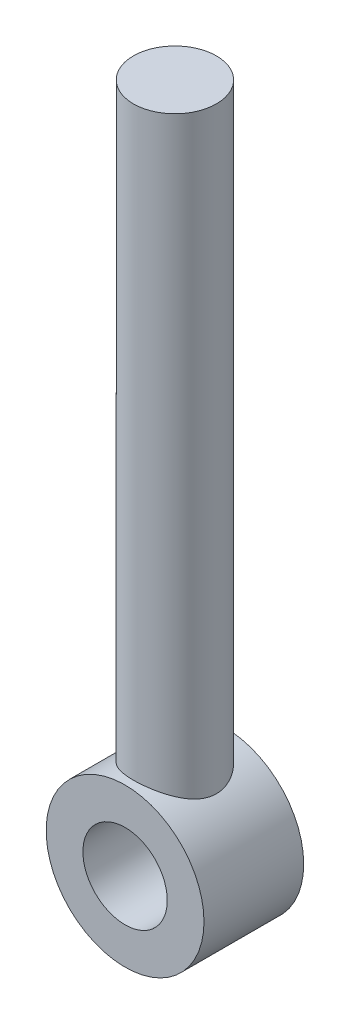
ISO-10303-21;
HEADER;
FILE_DESCRIPTION(('STEP AP214'),'2;1');
FILE_NAME('part.step','',(''),(''),'','','');
FILE_SCHEMA(('AUTOMOTIVE_DESIGN { 1 0 10303 214 1 1 1 1 }'));
ENDSEC;
DATA;
#1=APPLICATION_CONTEXT('core data for automotive mechanical design processes');
#2=APPLICATION_PROTOCOL_DEFINITION('international standard','automotive_design',2000,#1);
#3=PRODUCT_CONTEXT('',#1,'mechanical');
#4=PRODUCT('Part','Part','',(#3));
#5=PRODUCT_RELATED_PRODUCT_CATEGORY('part','',(#4));
#6=PRODUCT_DEFINITION_FORMATION('','',#4);
#7=PRODUCT_DEFINITION_CONTEXT('part definition',#1,'design');
#8=PRODUCT_DEFINITION('design','',#6,#7);
#9=PRODUCT_DEFINITION_SHAPE('','',#8);
#10=(LENGTH_UNIT() NAMED_UNIT(*) SI_UNIT(.MILLI.,.METRE.));
#11=(NAMED_UNIT(*) PLANE_ANGLE_UNIT() SI_UNIT($,.RADIAN.));
#12=(NAMED_UNIT(*) SI_UNIT($,.STERADIAN.) SOLID_ANGLE_UNIT());
#13=UNCERTAINTY_MEASURE_WITH_UNIT(LENGTH_MEASURE(1.E-05),#10,'distance_accuracy_value','');
#14=(GEOMETRIC_REPRESENTATION_CONTEXT(3) GLOBAL_UNCERTAINTY_ASSIGNED_CONTEXT((#13)) GLOBAL_UNIT_ASSIGNED_CONTEXT((#10,
#11,#12)) REPRESENTATION_CONTEXT('',''));
#15=CARTESIAN_POINT('',(0.,0.,0.));
#16=DIRECTION('',(0.,0.,1.));
#17=DIRECTION('',(1.,0.,0.));
#18=AXIS2_PLACEMENT_3D('',#15,#16,#17);
#19=CARTESIAN_POINT('',(0.,-12.7,-9.525));
#20=DIRECTION('',(0.,0.,1.));
#21=DIRECTION('',(1.,0.,0.));
#22=AXIS2_PLACEMENT_3D('',#19,#20,#21);
#23=CYLINDRICAL_SURFACE('',#22,15.08125);
#24=CARTESIAN_POINT('',(0.,-12.7,9.525));
#25=DIRECTION('',(0.,0.,1.));
#26=DIRECTION('',(1.,0.,0.));
#27=AXIS2_PLACEMENT_3D('',#24,#25,#26);
#28=CIRCLE('',#27,15.08125);
#29=CARTESIAN_POINT('',(15.08125,-12.7,9.525));
#30=VERTEX_POINT('',#29);
#31=EDGE_CURVE('E54',#30,#30,#28,.T.);
#32=ORIENTED_EDGE('',*,*,#31,.F.);
#33=EDGE_LOOP('',(#32));
#34=FACE_BOUND('',#33,.T.);
#35=CARTESIAN_POINT('',(0.,-12.7,-9.525));
#36=DIRECTION('',(0.,0.,1.));
#37=DIRECTION('',(1.,0.,0.));
#38=AXIS2_PLACEMENT_3D('',#35,#36,#37);
#39=CIRCLE('',#38,15.08125);
#40=CARTESIAN_POINT('',(15.08125,-12.7,-9.525));
#41=VERTEX_POINT('',#40);
#42=EDGE_CURVE('E47',#41,#41,#39,.T.);
#43=ORIENTED_EDGE('',*,*,#42,.T.);
#44=EDGE_LOOP('',(#43));
#45=FACE_BOUND('',#44,.T.);
#46=CARTESIAN_POINT('',(0.,2.38124999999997,-7.9375));
#47=CARTESIAN_POINT('',(-0.207394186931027,2.38125040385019,-7.93750049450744));
#48=CARTESIAN_POINT('',(-0.414782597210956,2.37696275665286,-7.92936320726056));
#49=CARTESIAN_POINT('',(-0.828014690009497,2.35992263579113,-7.89691493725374));
#50=CARTESIAN_POINT('',(-1.03385778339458,2.34716708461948,-7.87259807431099));
#51=CARTESIAN_POINT('',(-1.44260073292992,2.31349757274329,-7.80805173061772));
#52=CARTESIAN_POINT('',(-1.64549681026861,2.29257395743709,-7.7678034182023));
#53=CARTESIAN_POINT('',(-2.04672691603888,2.24308855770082,-7.67185684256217));
#54=CARTESIAN_POINT('',(-2.24505904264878,2.2145236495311,-7.61615226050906));
#55=CARTESIAN_POINT('',(-2.63491366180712,2.15059475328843,-7.49018721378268));
#56=CARTESIAN_POINT('',(-2.82646261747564,2.11526170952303,-7.41999288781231));
#57=CARTESIAN_POINT('',(-3.20259508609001,2.03853448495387,-7.26558126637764));
#58=CARTESIAN_POINT('',(-3.38717606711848,1.99713812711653,-7.1813589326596));
#59=CARTESIAN_POINT('',(-3.92877765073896,1.86524976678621,-6.90881639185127));
#60=CARTESIAN_POINT('',(-4.27405558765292,1.76699022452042,-6.7004903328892));
#61=CARTESIAN_POINT('',(-4.94790708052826,1.55116303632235,-6.22126354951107));
#62=CARTESIAN_POINT('',(-5.27394005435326,1.43275593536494,-5.94717795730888));
#63=CARTESIAN_POINT('',(-5.72656002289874,1.25267514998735,-5.50049825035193));
#64=CARTESIAN_POINT('',(-5.87145684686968,1.19219018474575,-5.34555005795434));
#65=CARTESIAN_POINT('',(-6.14854891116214,1.07179123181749,-5.02436250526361));
#66=CARTESIAN_POINT('',(-6.28074192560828,1.01187734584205,-4.85812117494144));
#67=CARTESIAN_POINT('',(-6.54281317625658,0.888910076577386,-4.49989226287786));
#68=CARTESIAN_POINT('',(-6.67144914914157,0.826048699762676,-4.30692847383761));
#69=CARTESIAN_POINT('',(-6.91183439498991,0.704803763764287,-3.90952046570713));
#70=CARTESIAN_POINT('',(-7.02359075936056,0.646418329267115,-3.70508111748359));
#71=CARTESIAN_POINT('',(-7.22924412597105,0.536153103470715,-3.28579312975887));
#72=CARTESIAN_POINT('',(-7.32314701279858,0.484271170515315,-3.07094794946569));
#73=CARTESIAN_POINT('',(-7.49206601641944,0.389020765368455,-2.63212910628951));
#74=CARTESIAN_POINT('',(-7.56708444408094,0.345651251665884,-2.40815656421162));
#75=CARTESIAN_POINT('',(-7.6931561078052,0.271679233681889,-1.96687473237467));
#76=CARTESIAN_POINT('',(-7.74540656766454,0.240452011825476,-1.75001291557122));
#77=CARTESIAN_POINT('',(-7.83160147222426,0.188470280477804,-1.31143209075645));
#78=CARTESIAN_POINT('',(-7.86554678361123,0.167715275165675,-1.08971331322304));
#79=CARTESIAN_POINT('',(-7.91453790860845,0.137640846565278,-0.643651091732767));
#80=CARTESIAN_POINT('',(-7.92960310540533,0.128309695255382,-0.419310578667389));
#81=CARTESIAN_POINT('',(-7.9406227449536,0.121492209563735,0.0300080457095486));
#82=CARTESIAN_POINT('',(-7.93657938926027,0.124004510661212,0.254986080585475));
#83=CARTESIAN_POINT('',(-7.91132031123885,0.139598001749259,0.672716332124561));
#84=CARTESIAN_POINT('',(-7.89252309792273,0.151190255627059,0.865676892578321));
#85=CARTESIAN_POINT('',(-7.84098674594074,0.18269935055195,1.2491027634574));
#86=CARTESIAN_POINT('',(-7.80824306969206,0.202618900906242,1.43956724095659));
#87=CARTESIAN_POINT('',(-7.72921466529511,0.250114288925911,1.81666250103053));
#88=CARTESIAN_POINT('',(-7.68293100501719,0.277689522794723,2.00329358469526));
#89=CARTESIAN_POINT('',(-7.57730353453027,0.339644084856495,2.37173405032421));
#90=CARTESIAN_POINT('',(-7.51795447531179,0.374026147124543,2.55354146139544));
#91=CARTESIAN_POINT('',(-7.38529913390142,0.449425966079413,2.91534096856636));
#92=CARTESIAN_POINT('',(-7.31171123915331,0.490574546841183,3.09520227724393));
#93=CARTESIAN_POINT('',(-7.15205829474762,0.577817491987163,3.44811460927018));
#94=CARTESIAN_POINT('',(-7.06598912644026,0.623913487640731,3.62116336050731));
#95=CARTESIAN_POINT('',(-6.88196115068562,0.719891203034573,3.95975400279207));
#96=CARTESIAN_POINT('',(-6.78400034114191,0.769773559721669,4.12529462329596));
#97=CARTESIAN_POINT('',(-6.57674863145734,0.872171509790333,4.44827008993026));
#98=CARTESIAN_POINT('',(-6.4674570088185,0.924687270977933,4.60570441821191));
#99=CARTESIAN_POINT('',(-6.22168528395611,1.03883585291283,4.93379435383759));
#100=CARTESIAN_POINT('',(-6.08355065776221,1.10070067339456,5.10313285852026));
#101=CARTESIAN_POINT('',(-5.7938748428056,1.22479607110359,5.42978641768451));
#102=CARTESIAN_POINT('',(-5.64233293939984,1.28702666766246,5.58710083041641));
#103=CARTESIAN_POINT('',(-5.32646473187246,1.41033769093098,5.88900925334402));
#104=CARTESIAN_POINT('',(-5.16213193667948,1.47141751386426,6.03359672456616));
#105=CARTESIAN_POINT('',(-4.82146501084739,1.59091194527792,6.30915082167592));
#106=CARTESIAN_POINT('',(-4.6451292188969,1.64932618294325,6.44011555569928));
#107=CARTESIAN_POINT('',(-4.2709149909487,1.76526522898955,6.69456893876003));
#108=CARTESIAN_POINT('',(-4.07238159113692,1.82254982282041,6.81720675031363));
#109=CARTESIAN_POINT('',(-3.66406217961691,1.93090355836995,7.04508248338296));
#110=CARTESIAN_POINT('',(-3.45428133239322,1.98197551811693,7.15032830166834));
#111=CARTESIAN_POINT('',(-3.02484600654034,2.07642422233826,7.34230893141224));
#112=CARTESIAN_POINT('',(-2.80519594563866,2.11980436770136,7.42905192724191));
#113=CARTESIAN_POINT('',(-2.35760575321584,2.19756235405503,7.58298003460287));
#114=CARTESIAN_POINT('',(-2.12966669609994,2.23194135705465,7.65016767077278));
#115=CARTESIAN_POINT('',(-1.68790767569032,2.28800105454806,7.75899170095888));
#116=CARTESIAN_POINT('',(-1.47462238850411,2.31053601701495,7.80236259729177));
#117=CARTESIAN_POINT('',(-1.04446183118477,2.34658661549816,7.87149588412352));
#118=CARTESIAN_POINT('',(-0.827586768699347,2.36010277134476,7.89725928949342));
#119=CARTESIAN_POINT('',(-0.392170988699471,2.37772391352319,7.93081121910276));
#120=CARTESIAN_POINT('',(-0.173631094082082,2.38183328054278,7.93860811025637));
#121=CARTESIAN_POINT('',(0.26331263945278,2.38053339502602,7.93613857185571));
#122=CARTESIAN_POINT('',(0.481716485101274,2.37512465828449,7.92587312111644));
#123=CARTESIAN_POINT('',(0.897313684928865,2.35584024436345,7.88912825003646));
#124=CARTESIAN_POINT('',(1.09467954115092,2.34275301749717,7.8641579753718));
#125=CARTESIAN_POINT('',(1.48642818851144,2.30910697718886,7.7996061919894));
#126=CARTESIAN_POINT('',(1.68080995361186,2.288545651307,7.76001976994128));
#127=CARTESIAN_POINT('',(2.06518186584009,2.24043614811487,7.66668338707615));
#128=CARTESIAN_POINT('',(2.25517342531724,2.2128902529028,7.61293805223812));
#129=CARTESIAN_POINT('',(2.62976260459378,2.15141397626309,7.49179713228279));
#130=CARTESIAN_POINT('',(2.81435809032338,2.11748110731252,7.42439622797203));
#131=CARTESIAN_POINT('',(3.18170393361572,2.04302748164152,7.27468162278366));
#132=CARTESIAN_POINT('',(3.3642880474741,2.00236116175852,7.1920323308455));
#133=CARTESIAN_POINT('',(3.72176867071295,1.91596427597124,7.01372091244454));
#134=CARTESIAN_POINT('',(3.89666255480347,1.87023199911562,6.91805438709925));
#135=CARTESIAN_POINT('',(4.40854109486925,1.72685604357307,6.6125982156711));
#136=CARTESIAN_POINT('',(4.73292149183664,1.62299134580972,6.38427020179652));
#137=CARTESIAN_POINT('',(5.37484577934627,1.39549969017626,5.85707040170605));
#138=CARTESIAN_POINT('',(5.68803699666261,1.27094446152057,5.5532913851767));
#139=CARTESIAN_POINT('',(6.11761900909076,1.08562023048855,5.06222173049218));
#140=CARTESIAN_POINT('',(6.25420466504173,1.02404862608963,4.89248275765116));
#141=CARTESIAN_POINT('',(6.51333581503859,0.902976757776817,4.54179172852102));
#142=CARTESIAN_POINT('',(6.6358790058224,0.843476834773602,4.36083784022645));
#143=CARTESIAN_POINT('',(6.87340686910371,0.724572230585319,3.97672861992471));
#144=CARTESIAN_POINT('',(6.98741688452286,0.665413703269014,3.77289316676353));
#145=CARTESIAN_POINT('',(7.19756616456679,0.553426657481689,3.35465065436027));
#146=CARTESIAN_POINT('',(7.29371405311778,0.500595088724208,3.14024876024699));
#147=CARTESIAN_POINT('',(7.46705987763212,0.403320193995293,2.70228305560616));
#148=CARTESIAN_POINT('',(7.54427453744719,0.358869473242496,2.47872753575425));
#149=CARTESIAN_POINT('',(7.67878518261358,0.280233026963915,2.02394697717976));
#150=CARTESIAN_POINT('',(7.73608462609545,0.246045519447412,1.79272327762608));
#151=CARTESIAN_POINT('',(7.82523454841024,0.192332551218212,1.34758159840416));
#152=CARTESIAN_POINT('',(7.85902730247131,0.171699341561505,1.13418553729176));
#153=CARTESIAN_POINT('',(7.90912147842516,0.140980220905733,0.704593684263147));
#154=CARTESIAN_POINT('',(7.92542414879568,0.130893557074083,0.488398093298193));
#155=CARTESIAN_POINT('',(7.94026335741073,0.121715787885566,0.0552791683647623));
#156=CARTESIAN_POINT('',(7.93880925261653,0.122618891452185,-0.161643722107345));
#157=CARTESIAN_POINT('',(7.91818152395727,0.135367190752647,-0.594311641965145));
#158=CARTESIAN_POINT('',(7.89900896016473,0.147211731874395,-0.810056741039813));
#159=CARTESIAN_POINT('',(7.84650775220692,0.179333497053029,-1.21354220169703));
#160=CARTESIAN_POINT('',(7.8150811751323,0.19847196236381,-1.40162570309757));
#161=CARTESIAN_POINT('',(7.7390047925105,0.244260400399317,-1.77422610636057));
#162=CARTESIAN_POINT('',(7.69435067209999,0.270912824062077,-1.9587418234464));
#163=CARTESIAN_POINT('',(7.59229978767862,0.330908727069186,-2.32307353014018));
#164=CARTESIAN_POINT('',(7.53490439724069,0.364251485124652,-2.5028900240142));
#165=CARTESIAN_POINT('',(7.4078951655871,0.436686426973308,-2.85699488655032));
#166=CARTESIAN_POINT('',(7.33827648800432,0.475780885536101,-3.03128103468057));
#167=CARTESIAN_POINT('',(7.10209356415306,0.605563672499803,-3.56688597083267));
#168=CARTESIAN_POINT('',(6.91480321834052,0.704678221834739,-3.91725817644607));
#169=CARTESIAN_POINT('',(6.49213724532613,0.914395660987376,-4.58389307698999));
#170=CARTESIAN_POINT('',(6.2567357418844,1.02500471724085,-4.90013727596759));
#171=CARTESIAN_POINT('',(5.85300618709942,1.20007337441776,-5.36622673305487));
#172=CARTESIAN_POINT('',(5.69931167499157,1.26394393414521,-5.52918943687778));
#173=CARTESIAN_POINT('',(5.37849708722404,1.39062003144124,-5.84172864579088));
#174=CARTESIAN_POINT('',(5.21138102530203,1.45342588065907,-5.99130912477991));
#175=CARTESIAN_POINT('',(4.86436402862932,1.5764135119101,-6.27633069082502));
#176=CARTESIAN_POINT('',(4.68445328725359,1.63659322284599,-6.41176073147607));
#177=CARTESIAN_POINT('',(4.31280547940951,1.75274058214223,-6.66741965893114));
#178=CARTESIAN_POINT('',(4.1210670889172,1.80870775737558,-6.78764683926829));
#179=CARTESIAN_POINT('',(3.72274660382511,1.91604134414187,-7.01417308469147));
#180=CARTESIAN_POINT('',(3.51594044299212,1.96728957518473,-7.12013515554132));
#181=CARTESIAN_POINT('',(3.09250050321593,2.06237088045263,-7.31399569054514));
#182=CARTESIAN_POINT('',(2.87587162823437,2.10620760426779,-7.40190304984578));
#183=CARTESIAN_POINT('',(2.43472531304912,2.18510369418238,-7.55848415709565));
#184=CARTESIAN_POINT('',(2.21022513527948,2.22018104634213,-7.62719735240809));
#185=CARTESIAN_POINT('',(1.75488650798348,2.28055967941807,-7.74464426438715));
#186=CARTESIAN_POINT('',(1.5240517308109,2.30586650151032,-7.793389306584));
#187=CARTESIAN_POINT('',(1.07831022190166,2.34416722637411,-7.86687107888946));
#188=CARTESIAN_POINT('',(0.863760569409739,2.35803937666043,-7.89332477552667));
#189=CARTESIAN_POINT('',(0.432805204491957,2.37658063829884,-7.92863914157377));
#190=CARTESIAN_POINT('',(0.216399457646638,2.38124957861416,-7.93749948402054));
#191=CARTESIAN_POINT('',(0.,2.38124999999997,-7.9375));
#192=B_SPLINE_CURVE_WITH_KNOTS('',3,(#46,#47,#48,#49,#50,#51,#52,#53,#54,#55,#56,#57,#58,#59,
#60,#61,#62,#63,#64,#65,#66,#67,#68,#69,#70,#71,#72,#73,#74,#75,#76,#77,#78,#79,#80,#81,#82,#83,
#84,#85,#86,#87,#88,#89,#90,#91,#92,#93,#94,#95,#96,#97,#98,#99,#100,#101,#102,#103,#104,#105,
#106,#107,#108,#109,#110,#111,#112,#113,#114,#115,#116,#117,#118,#119,#120,#121,#122,#123,#124,
#125,#126,#127,#128,#129,#130,#131,#132,#133,#134,#135,#136,#137,#138,#139,#140,#141,#142,#143,
#144,#145,#146,#147,#148,#149,#150,#151,#152,#153,#154,#155,#156,#157,#158,#159,#160,#161,#162,
#163,#164,#165,#166,#167,#168,#169,#170,#171,#172,#173,#174,#175,#176,#177,#178,#179,#180,#181,
#182,#183,#184,#185,#186,#187,#188,#189,#190,#191),.UNSPECIFIED.,.T.,.F.,(4,2,2,2,2,2,2,2,2,2,2,
2,2,2,2,2,2,2,2,2,2,2,2,2,2,2,2,2,2,2,2,2,2,2,2,2,2,2,2,2,2,2,2,2,2,2,2,2,2,2,2,2,2,2,2,2,2,2,2,
2,2,2,2,2,2,2,2,2,2,2,2,2,4),(0.,0.621970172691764,1.24416651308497,1.86710052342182,
2.4902895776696,3.11069459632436,3.73132292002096,4.97131934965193,6.2918349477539,
6.95308655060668,7.61445380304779,8.33440442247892,9.05405173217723,9.7734614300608,
10.4927830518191,11.1675188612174,11.8422227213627,12.5162333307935,13.1901662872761,
13.7721389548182,14.3543011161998,14.9364173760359,15.5187679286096,16.1140987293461,
16.7096264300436,17.3052545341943,17.9009206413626,18.5815488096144,19.2622132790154,
19.9432254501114,20.6243320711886,21.3442373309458,22.0638148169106,22.783073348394,
23.5022389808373,24.1577875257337,24.813298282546,25.4685037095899,26.1236736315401,
26.7210860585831,27.3186994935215,27.916117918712,28.5137695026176,29.1266165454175,
29.7396712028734,30.9651303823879,32.3202167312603,32.9988386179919,33.6775716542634,
34.3994208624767,35.1209206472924,35.8417808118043,36.5625157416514,37.2126905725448,
37.8628189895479,38.5126048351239,39.1623518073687,39.7366591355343,40.311154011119,
40.8855869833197,41.4602477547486,42.6835729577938,43.9075578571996,44.6056871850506,
45.3036085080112,46.0020706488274,46.7006111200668,47.4135065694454,48.1260499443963,
48.8371179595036,49.5477821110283,50.1967468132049,50.8457235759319),.UNSPECIFIED.);
#193=CARTESIAN_POINT('',(0.,2.38124999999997,-7.9375));
#194=VERTEX_POINT('',#193);
#195=EDGE_CURVE('E37',#194,#194,#192,.T.);
#196=ORIENTED_EDGE('',*,*,#195,.F.);
#197=EDGE_LOOP('',(#196));
#198=FACE_BOUND('',#197,.T.);
#199=ADVANCED_FACE('F32',(#34,#45,#198),#23,.T.);
#200=CARTESIAN_POINT('',(0.,-12.7,-9.525));
#201=DIRECTION('',(0.,0.,1.));
#202=DIRECTION('',(1.,0.,0.));
#203=AXIS2_PLACEMENT_3D('',#200,#201,#202);
#204=PLANE('',#203);
#205=CARTESIAN_POINT('',(0.,-12.7,-9.525));
#206=DIRECTION('',(0.,0.,1.));
#207=DIRECTION('',(1.,0.,0.));
#208=AXIS2_PLACEMENT_3D('',#205,#206,#207);
#209=CIRCLE('',#208,8.06001496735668);
#210=CARTESIAN_POINT('',(8.06001496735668,-12.7,-9.525));
#211=VERTEX_POINT('',#210);
#212=EDGE_CURVE('E51',#211,#211,#209,.T.);
#213=ORIENTED_EDGE('',*,*,#212,.T.);
#214=EDGE_LOOP('',(#213));
#215=FACE_BOUND('',#214,.T.);
#216=ORIENTED_EDGE('',*,*,#42,.F.);
#217=EDGE_LOOP('',(#216));
#218=FACE_BOUND('',#217,.T.);
#219=ADVANCED_FACE('F73',(#215,#218),#204,.F.);
#220=CARTESIAN_POINT('',(0.,-12.7,-9.525));
#221=DIRECTION('',(0.,0.,1.));
#222=DIRECTION('',(1.,0.,0.));
#223=AXIS2_PLACEMENT_3D('',#220,#221,#222);
#224=CYLINDRICAL_SURFACE('',#223,8.06001496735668);
#225=CARTESIAN_POINT('',(0.,-12.7,9.525));
#226=DIRECTION('',(0.,0.,1.));
#227=DIRECTION('',(1.,0.,0.));
#228=AXIS2_PLACEMENT_3D('',#225,#226,#227);
#229=CIRCLE('',#228,8.06001496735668);
#230=CARTESIAN_POINT('',(8.06001496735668,-12.7,9.525));
#231=VERTEX_POINT('',#230);
#232=EDGE_CURVE('E57',#231,#231,#229,.T.);
#233=CARTESIAN_POINT('',(8.06001496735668,-12.7,-9.525));
#234=CARTESIAN_POINT('',(8.06001496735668,-12.7,-9.3265625));
#235=CARTESIAN_POINT('',(8.06001496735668,-12.7,-9.128125));
#236=CARTESIAN_POINT('',(8.06001496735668,-12.7,-8.73125));
#237=CARTESIAN_POINT('',(8.06001496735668,-12.7,-8.5328125));
#238=CARTESIAN_POINT('',(8.06001496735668,-12.7,-8.1359375));
#239=CARTESIAN_POINT('',(8.06001496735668,-12.7,-7.9375));
#240=CARTESIAN_POINT('',(8.06001496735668,-12.7,-7.540625));
#241=CARTESIAN_POINT('',(8.06001496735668,-12.7,-7.3421875));
#242=CARTESIAN_POINT('',(8.06001496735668,-12.7,-6.9453125));
#243=CARTESIAN_POINT('',(8.06001496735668,-12.7,-6.746875));
#244=CARTESIAN_POINT('',(8.06001496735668,-12.7,-6.35));
#245=CARTESIAN_POINT('',(8.06001496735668,-12.7,-6.1515625));
#246=CARTESIAN_POINT('',(8.06001496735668,-12.7,-5.7546875));
#247=CARTESIAN_POINT('',(8.06001496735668,-12.7,-5.55625));
#248=CARTESIAN_POINT('',(8.06001496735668,-12.7,-5.159375));
#249=CARTESIAN_POINT('',(8.06001496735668,-12.7,-4.9609375));
#250=CARTESIAN_POINT('',(8.06001496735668,-12.7,-4.5640625));
#251=CARTESIAN_POINT('',(8.06001496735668,-12.7,-4.365625));
#252=CARTESIAN_POINT('',(8.06001496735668,-12.7,-3.96875));
#253=CARTESIAN_POINT('',(8.06001496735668,-12.7,-3.7703125));
#254=CARTESIAN_POINT('',(8.06001496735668,-12.7,-3.3734375));
#255=CARTESIAN_POINT('',(8.06001496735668,-12.7,-3.175));
#256=CARTESIAN_POINT('',(8.06001496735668,-12.7,-2.778125));
#257=CARTESIAN_POINT('',(8.06001496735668,-12.7,-2.5796875));
#258=CARTESIAN_POINT('',(8.06001496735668,-12.7,-2.1828125));
#259=CARTESIAN_POINT('',(8.06001496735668,-12.7,-1.984375));
#260=CARTESIAN_POINT('',(8.06001496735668,-12.7,-1.5875));
#261=CARTESIAN_POINT('',(8.06001496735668,-12.7,-1.3890625));
#262=CARTESIAN_POINT('',(8.06001496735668,-12.7,-0.992187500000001));
#263=CARTESIAN_POINT('',(8.06001496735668,-12.7,-0.793750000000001));
#264=CARTESIAN_POINT('',(8.06001496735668,-12.7,-0.396875));
#265=CARTESIAN_POINT('',(8.06001496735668,-12.7,-0.1984375));
#266=CARTESIAN_POINT('',(8.06001496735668,-12.7,0.1984375));
#267=CARTESIAN_POINT('',(8.06001496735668,-12.7,0.396875));
#268=CARTESIAN_POINT('',(8.06001496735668,-12.7,0.793750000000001));
#269=CARTESIAN_POINT('',(8.06001496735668,-12.7,0.992187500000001));
#270=CARTESIAN_POINT('',(8.06001496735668,-12.7,1.3890625));
#271=CARTESIAN_POINT('',(8.06001496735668,-12.7,1.5875));
#272=CARTESIAN_POINT('',(8.06001496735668,-12.7,1.984375));
#273=CARTESIAN_POINT('',(8.06001496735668,-12.7,2.1828125));
#274=CARTESIAN_POINT('',(8.06001496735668,-12.7,2.5796875));
#275=CARTESIAN_POINT('',(8.06001496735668,-12.7,2.778125));
#276=CARTESIAN_POINT('',(8.06001496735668,-12.7,3.175));
#277=CARTESIAN_POINT('',(8.06001496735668,-12.7,3.3734375));
#278=CARTESIAN_POINT('',(8.06001496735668,-12.7,3.7703125));
#279=CARTESIAN_POINT('',(8.06001496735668,-12.7,3.96875));
#280=CARTESIAN_POINT('',(8.06001496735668,-12.7,4.365625));
#281=CARTESIAN_POINT('',(8.06001496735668,-12.7,4.5640625));
#282=CARTESIAN_POINT('',(8.06001496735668,-12.7,4.9609375));
#283=CARTESIAN_POINT('',(8.06001496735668,-12.7,5.159375));
#284=CARTESIAN_POINT('',(8.06001496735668,-12.7,5.55625));
#285=CARTESIAN_POINT('',(8.06001496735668,-12.7,5.7546875));
#286=CARTESIAN_POINT('',(8.06001496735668,-12.7,6.1515625));
#287=CARTESIAN_POINT('',(8.06001496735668,-12.7,6.35));
#288=CARTESIAN_POINT('',(8.06001496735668,-12.7,6.746875));
#289=CARTESIAN_POINT('',(8.06001496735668,-12.7,6.9453125));
#290=CARTESIAN_POINT('',(8.06001496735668,-12.7,7.3421875));
#291=CARTESIAN_POINT('',(8.06001496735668,-12.7,7.540625));
#292=CARTESIAN_POINT('',(8.06001496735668,-12.7,7.9375));
#293=CARTESIAN_POINT('',(8.06001496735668,-12.7,8.1359375));
#294=CARTESIAN_POINT('',(8.06001496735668,-12.7,8.5328125));
#295=CARTESIAN_POINT('',(8.06001496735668,-12.7,8.73125));
#296=CARTESIAN_POINT('',(8.06001496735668,-12.7,9.128125));
#297=CARTESIAN_POINT('',(8.06001496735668,-12.7,9.3265625));
#298=CARTESIAN_POINT('',(8.06001496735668,-12.7,9.525));
#299=B_SPLINE_CURVE_WITH_KNOTS('',3,(#233,#234,#235,#236,#237,#238,#239,#240,#241,#242,#243,
#244,#245,#246,#247,#248,#249,#250,#251,#252,#253,#254,#255,#256,#257,#258,#259,#260,#261,#262,
#263,#264,#265,#266,#267,#268,#269,#270,#271,#272,#273,#274,#275,#276,#277,#278,#279,#280,#281,
#282,#283,#284,#285,#286,#287,#288,#289,#290,#291,#292,#293,#294,#295,#296,#297,#298),
.UNSPECIFIED.,.F.,.F.,(4,2,2,2,2,2,2,2,2,2,2,2,2,2,2,2,2,2,2,2,2,2,2,2,2,2,2,2,2,2,2,2,4),(0.,
0.595312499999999,1.190625,1.7859375,2.38125,2.9765625,3.571875,4.1671875,4.7625,5.3578125,
5.953125,6.5484375,7.14375,7.7390625,8.334375,8.9296875,9.525,10.1203125,10.715625,11.3109375,
11.90625,12.5015625,13.096875,13.6921875,14.2875,14.8828125,15.478125,16.0734375,16.66875,
17.2640625,17.859375,18.4546875,19.05),.UNSPECIFIED.);
#300=EDGE_CURVE('BSEAM61',#211,#231,#299,.T.);
#301=ORIENTED_EDGE('',*,*,#212,.F.);
#302=ORIENTED_EDGE('',*,*,#232,.T.);
#303=ORIENTED_EDGE('',*,*,#300,.T.);
#304=ORIENTED_EDGE('',*,*,#300,.F.);
#305=EDGE_LOOP('',(#301,#303,#302,#304));
#306=FACE_BOUND('',#305,.T.);
#307=ADVANCED_FACE('F61',(#306),#224,.F.);
#308=CARTESIAN_POINT('',(0.,-12.7,9.525));
#309=DIRECTION('',(0.,0.,1.));
#310=DIRECTION('',(1.,0.,0.));
#311=AXIS2_PLACEMENT_3D('',#308,#309,#310);
#312=PLANE('',#311);
#313=ORIENTED_EDGE('',*,*,#31,.T.);
#314=EDGE_LOOP('',(#313));
#315=FACE_BOUND('',#314,.T.);
#316=ORIENTED_EDGE('',*,*,#232,.F.);
#317=EDGE_LOOP('',(#316));
#318=FACE_BOUND('',#317,.T.);
#319=ADVANCED_FACE('F63',(#315,#318),#312,.T.);
#320=CARTESIAN_POINT('',(0.,114.3,0.));
#321=DIRECTION('',(0.,-1.,0.));
#322=DIRECTION('',(0.,0.,-1.));
#323=AXIS2_PLACEMENT_3D('',#320,#321,#322);
#324=CYLINDRICAL_SURFACE('',#323,7.9375);
#325=ORIENTED_EDGE('',*,*,#195,.T.);
#326=EDGE_LOOP('',(#325));
#327=FACE_BOUND('',#326,.T.);
#328=CARTESIAN_POINT('',(0.,114.3,0.));
#329=DIRECTION('',(0.,1.,0.));
#330=DIRECTION('',(0.,0.,1.));
#331=AXIS2_PLACEMENT_3D('',#328,#329,#330);
#332=CIRCLE('',#331,7.9375);
#333=CARTESIAN_POINT('',(0.,114.3,7.9375));
#334=VERTEX_POINT('',#333);
#335=EDGE_CURVE('E10',#334,#334,#332,.T.);
#336=ORIENTED_EDGE('',*,*,#335,.F.);
#337=EDGE_LOOP('',(#336));
#338=FACE_BOUND('',#337,.T.);
#339=ADVANCED_FACE('F34',(#327,#338),#324,.T.);
#340=CARTESIAN_POINT('',(0.,114.3,0.));
#341=DIRECTION('',(0.,1.,0.));
#342=DIRECTION('',(0.,0.,1.));
#343=AXIS2_PLACEMENT_3D('',#340,#341,#342);
#344=PLANE('',#343);
#345=ORIENTED_EDGE('',*,*,#335,.T.);
#346=EDGE_LOOP('',(#345));
#347=FACE_BOUND('',#346,.T.);
#348=ADVANCED_FACE('F71',(#347),#344,.T.);
#349=CLOSED_SHELL('',(#199,#219,#307,#319,#339,#348));
#350=MANIFOLD_SOLID_BREP('B2',#349);
#351=ADVANCED_BREP_SHAPE_REPRESENTATION('',(#18,#350),#14);
#352=SHAPE_DEFINITION_REPRESENTATION(#9,#351);
ENDSEC;
END-ISO-10303-21;
